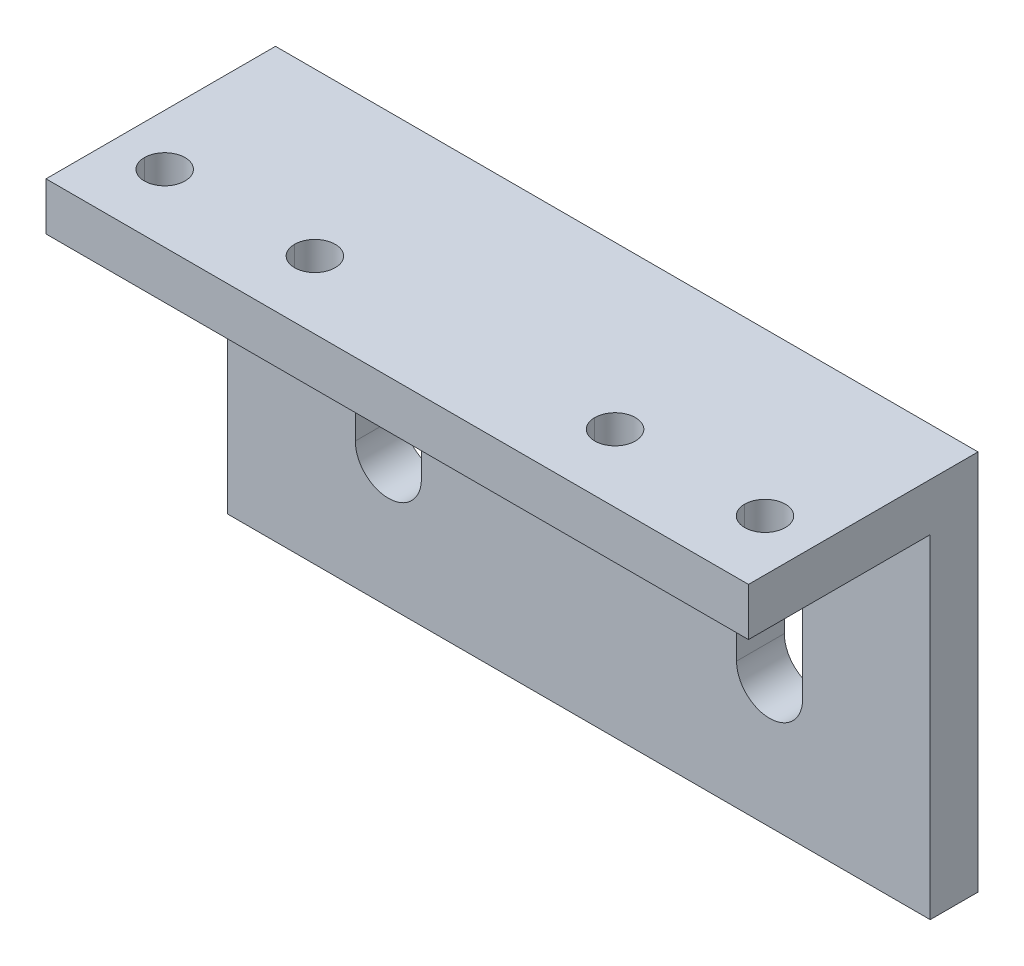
ISO-10303-21;
HEADER;
FILE_DESCRIPTION(('STEP AP214'),'2;1');
FILE_NAME('part.step','',(''),(''),'','','');
FILE_SCHEMA(('AUTOMOTIVE_DESIGN { 1 0 10303 214 1 1 1 1 }'));
ENDSEC;
DATA;
#1=APPLICATION_CONTEXT('core data for automotive mechanical design processes');
#2=APPLICATION_PROTOCOL_DEFINITION('international standard','automotive_design',2000,#1);
#3=PRODUCT_CONTEXT('',#1,'mechanical');
#4=PRODUCT('Part','Part','',(#3));
#5=PRODUCT_RELATED_PRODUCT_CATEGORY('part','',(#4));
#6=PRODUCT_DEFINITION_FORMATION('','',#4);
#7=PRODUCT_DEFINITION_CONTEXT('part definition',#1,'design');
#8=PRODUCT_DEFINITION('design','',#6,#7);
#9=PRODUCT_DEFINITION_SHAPE('','',#8);
#10=(LENGTH_UNIT() NAMED_UNIT(*) SI_UNIT(.MILLI.,.METRE.));
#11=(NAMED_UNIT(*) PLANE_ANGLE_UNIT() SI_UNIT($,.RADIAN.));
#12=(NAMED_UNIT(*) SI_UNIT($,.STERADIAN.) SOLID_ANGLE_UNIT());
#13=UNCERTAINTY_MEASURE_WITH_UNIT(LENGTH_MEASURE(1.E-05),#10,'distance_accuracy_value','');
#14=(GEOMETRIC_REPRESENTATION_CONTEXT(3) GLOBAL_UNCERTAINTY_ASSIGNED_CONTEXT((#13)) GLOBAL_UNIT_ASSIGNED_CONTEXT((#10,
#11,#12)) REPRESENTATION_CONTEXT('',''));
#15=CARTESIAN_POINT('',(0.,0.,0.));
#16=DIRECTION('',(0.,0.,1.));
#17=DIRECTION('',(1.,0.,0.));
#18=AXIS2_PLACEMENT_3D('',#15,#16,#17);
#19=CARTESIAN_POINT('',(-16.0528,-12.7,4.77519999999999));
#20=DIRECTION('',(0.,0.,1.));
#21=DIRECTION('',(0.,-1.,0.));
#22=AXIS2_PLACEMENT_3D('',#19,#20,#21);
#23=PLANE('',#22);
#24=DIRECTION('',(0.,1.,0.));
#25=VECTOR('',#24,1.);
#26=CARTESIAN_POINT('',(-16.0528,11.1082666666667,4.77519999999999));
#27=LINE('',#26,#25);
#28=CARTESIAN_POINT('',(-16.0528,-12.7,4.77519999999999));
#29=VERTEX_POINT('',#28);
#30=CARTESIAN_POINT('',(-16.0528,20.6248,4.77519999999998));
#31=VERTEX_POINT('',#30);
#32=EDGE_CURVE('E308',#29,#31,#27,.T.);
#33=ORIENTED_EDGE('',*,*,#32,.F.);
#34=DIRECTION('',(1.,0.,0.));
#35=VECTOR('',#34,1.);
#36=CARTESIAN_POINT('',(-16.0528,-12.7,4.77519999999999));
#37=LINE('',#36,#35);
#38=CARTESIAN_POINT('',(54.1528,-12.7,4.77519999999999));
#39=VERTEX_POINT('',#38);
#40=EDGE_CURVE('E303',#39,#29,#37,.F.);
#41=ORIENTED_EDGE('',*,*,#40,.F.);
#42=DIRECTION('',(0.,1.,0.));
#43=VECTOR('',#42,1.);
#44=CARTESIAN_POINT('',(54.1528,25.4,4.77519999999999));
#45=LINE('',#44,#43);
#46=CARTESIAN_POINT('',(54.1528,20.6248,4.77519999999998));
#47=VERTEX_POINT('',#46);
#48=EDGE_CURVE('E269',#39,#47,#45,.T.);
#49=ORIENTED_EDGE('',*,*,#48,.T.);
#50=DIRECTION('',(1.,0.,0.));
#51=VECTOR('',#50,1.);
#52=CARTESIAN_POINT('',(-16.0528,20.6248,4.77519999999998));
#53=LINE('',#52,#51);
#54=EDGE_CURVE('E169',#31,#47,#53,.T.);
#55=ORIENTED_EDGE('',*,*,#54,.F.);
#56=EDGE_LOOP('',(#33,#41,#49,#55));
#57=FACE_BOUND('',#56,.T.);
#58=CARTESIAN_POINT('',(0.,12.7,4.7752));
#59=DIRECTION('',(0.,0.,1.));
#60=DIRECTION('',(1.,0.,0.));
#61=AXIS2_PLACEMENT_3D('',#58,#59,#60);
#62=CIRCLE('',#61,3.302);
#63=CARTESIAN_POINT('',(-3.302,12.7,4.7752));
#64=VERTEX_POINT('',#63);
#65=CARTESIAN_POINT('',(3.302,12.7,4.7752));
#66=VERTEX_POINT('',#65);
#67=EDGE_CURVE('E212',#64,#66,#62,.F.);
#68=ORIENTED_EDGE('',*,*,#67,.T.);
#69=DIRECTION('',(0.,1.,0.));
#70=VECTOR('',#69,1.);
#71=CARTESIAN_POINT('',(3.302,12.7,4.7752));
#72=LINE('',#71,#70);
#73=CARTESIAN_POINT('',(3.302,0.,4.7752));
#74=VERTEX_POINT('',#73);
#75=EDGE_CURVE('E263',#66,#74,#72,.F.);
#76=ORIENTED_EDGE('',*,*,#75,.T.);
#77=CARTESIAN_POINT('',(0.,0.,4.7752));
#78=DIRECTION('',(0.,0.,1.));
#79=DIRECTION('',(1.,0.,0.));
#80=AXIS2_PLACEMENT_3D('',#77,#78,#79);
#81=CIRCLE('',#80,3.302);
#82=CARTESIAN_POINT('',(-3.302,0.,4.7752));
#83=VERTEX_POINT('',#82);
#84=EDGE_CURVE('E208',#74,#83,#81,.F.);
#85=ORIENTED_EDGE('',*,*,#84,.T.);
#86=DIRECTION('',(0.,1.,0.));
#87=VECTOR('',#86,1.);
#88=CARTESIAN_POINT('',(-3.302,0.,4.7752));
#89=LINE('',#88,#87);
#90=EDGE_CURVE('E266',#83,#64,#89,.T.);
#91=ORIENTED_EDGE('',*,*,#90,.T.);
#92=EDGE_LOOP('',(#68,#76,#85,#91));
#93=FACE_BOUND('',#92,.T.);
#94=DIRECTION('',(0.,1.,0.));
#95=VECTOR('',#94,1.);
#96=CARTESIAN_POINT('',(34.798,0.,4.7752));
#97=LINE('',#96,#95);
#98=CARTESIAN_POINT('',(34.798,0.,4.7752));
#99=VERTEX_POINT('',#98);
#100=CARTESIAN_POINT('',(34.798,12.7,4.7752));
#101=VERTEX_POINT('',#100);
#102=EDGE_CURVE('E256',#99,#101,#97,.T.);
#103=ORIENTED_EDGE('',*,*,#102,.T.);
#104=CARTESIAN_POINT('',(38.1,12.7,4.7752));
#105=DIRECTION('',(0.,0.,1.));
#106=DIRECTION('',(1.,0.,0.));
#107=AXIS2_PLACEMENT_3D('',#104,#105,#106);
#108=CIRCLE('',#107,3.302);
#109=CARTESIAN_POINT('',(41.402,12.7,4.7752));
#110=VERTEX_POINT('',#109);
#111=EDGE_CURVE('E200',#101,#110,#108,.F.);
#112=ORIENTED_EDGE('',*,*,#111,.T.);
#113=DIRECTION('',(0.,1.,0.));
#114=VECTOR('',#113,1.);
#115=CARTESIAN_POINT('',(41.402,12.7,4.7752));
#116=LINE('',#115,#114);
#117=CARTESIAN_POINT('',(41.402,0.,4.7752));
#118=VERTEX_POINT('',#117);
#119=EDGE_CURVE('E260',#110,#118,#116,.F.);
#120=ORIENTED_EDGE('',*,*,#119,.T.);
#121=CARTESIAN_POINT('',(38.1,0.,4.7752));
#122=DIRECTION('',(0.,0.,1.));
#123=DIRECTION('',(1.,0.,0.));
#124=AXIS2_PLACEMENT_3D('',#121,#122,#123);
#125=CIRCLE('',#124,3.302);
#126=EDGE_CURVE('E205',#118,#99,#125,.F.);
#127=ORIENTED_EDGE('',*,*,#126,.T.);
#128=EDGE_LOOP('',(#103,#112,#120,#127));
#129=FACE_BOUND('',#128,.T.);
#130=ADVANCED_FACE('F17',(#57,#93,#129),#23,.T.);
#131=CARTESIAN_POINT('',(-16.0528,20.6248,4.77519999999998));
#132=DIRECTION('',(0.,-1.,0.));
#133=DIRECTION('',(0.,0.,-1.));
#134=AXIS2_PLACEMENT_3D('',#131,#132,#133);
#135=PLANE('',#134);
#136=DIRECTION('',(0.,0.,1.));
#137=VECTOR('',#136,1.);
#138=CARTESIAN_POINT('',(-16.0528,20.6248,9.23713333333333));
#139=LINE('',#138,#137);
#140=CARTESIAN_POINT('',(-16.0528,20.6248,22.9362));
#141=VERTEX_POINT('',#140);
#142=EDGE_CURVE('E311',#31,#141,#139,.T.);
#143=ORIENTED_EDGE('',*,*,#142,.F.);
#144=ORIENTED_EDGE('',*,*,#54,.T.);
#145=DIRECTION('',(0.,0.,1.));
#146=VECTOR('',#145,1.);
#147=CARTESIAN_POINT('',(54.1528,20.6248,0.));
#148=LINE('',#147,#146);
#149=CARTESIAN_POINT('',(54.1528,20.6248,22.9362));
#150=VERTEX_POINT('',#149);
#151=EDGE_CURVE('E296',#47,#150,#148,.T.);
#152=ORIENTED_EDGE('',*,*,#151,.T.);
#153=DIRECTION('',(1.,0.,0.));
#154=VECTOR('',#153,1.);
#155=CARTESIAN_POINT('',(-16.0528,20.6247999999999,22.9362));
#156=LINE('',#155,#154);
#157=EDGE_CURVE('E262',#141,#150,#156,.T.);
#158=ORIENTED_EDGE('',*,*,#157,.F.);
#159=EDGE_LOOP('',(#143,#144,#152,#158));
#160=FACE_BOUND('',#159,.T.);
#161=CARTESIAN_POINT('',(-10.9474,20.6248,16.1798000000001));
#162=DIRECTION('',(0.,-1.,0.));
#163=DIRECTION('',(0.,0.,-1.));
#164=AXIS2_PLACEMENT_3D('',#161,#162,#163);
#165=CIRCLE('',#164,2.032);
#166=CARTESIAN_POINT('',(-8.9154,20.6248,16.1798000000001));
#167=VERTEX_POINT('',#166);
#168=CARTESIAN_POINT('',(-12.9794,20.6248,16.1798000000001));
#169=VERTEX_POINT('',#168);
#170=EDGE_CURVE('E196',#167,#169,#165,.F.);
#171=ORIENTED_EDGE('',*,*,#170,.T.);
#172=CARTESIAN_POINT('',(-10.9474,20.6248,16.1798000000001));
#173=DIRECTION('',(0.,-1.,0.));
#174=DIRECTION('',(0.,0.,-1.));
#175=AXIS2_PLACEMENT_3D('',#172,#173,#174);
#176=CIRCLE('',#175,2.032);
#177=EDGE_CURVE('E194',#169,#167,#176,.F.);
#178=ORIENTED_EDGE('',*,*,#177,.T.);
#179=EDGE_LOOP('',(#171,#178));
#180=FACE_BOUND('',#179,.T.);
#181=CARTESIAN_POINT('',(49.0474,20.6248,16.1798000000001));
#182=DIRECTION('',(0.,-1.,0.));
#183=DIRECTION('',(0.,0.,-1.));
#184=AXIS2_PLACEMENT_3D('',#181,#182,#183);
#185=CIRCLE('',#184,2.032);
#186=CARTESIAN_POINT('',(51.0794,20.6248,16.1798000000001));
#187=VERTEX_POINT('',#186);
#188=CARTESIAN_POINT('',(47.0154,20.6248,16.1798000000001));
#189=VERTEX_POINT('',#188);
#190=EDGE_CURVE('E190',#187,#189,#185,.F.);
#191=ORIENTED_EDGE('',*,*,#190,.T.);
#192=CARTESIAN_POINT('',(49.0474,20.6248,16.1798000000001));
#193=DIRECTION('',(0.,-1.,0.));
#194=DIRECTION('',(0.,0.,-1.));
#195=AXIS2_PLACEMENT_3D('',#192,#193,#194);
#196=CIRCLE('',#195,2.032);
#197=EDGE_CURVE('E188',#189,#187,#196,.F.);
#198=ORIENTED_EDGE('',*,*,#197,.T.);
#199=EDGE_LOOP('',(#191,#198));
#200=FACE_BOUND('',#199,.T.);
#201=CARTESIAN_POINT('',(4.064,20.6248,16.1798000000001));
#202=DIRECTION('',(0.,-1.,0.));
#203=DIRECTION('',(0.,0.,-1.));
#204=AXIS2_PLACEMENT_3D('',#201,#202,#203);
#205=CIRCLE('',#204,2.032);
#206=CARTESIAN_POINT('',(6.096,20.6248,16.1798000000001));
#207=VERTEX_POINT('',#206);
#208=CARTESIAN_POINT('',(2.032,20.6248,16.1798000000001));
#209=VERTEX_POINT('',#208);
#210=EDGE_CURVE('E185',#207,#209,#205,.F.);
#211=ORIENTED_EDGE('',*,*,#210,.T.);
#212=CARTESIAN_POINT('',(4.064,20.6248,16.1798000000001));
#213=DIRECTION('',(0.,-1.,0.));
#214=DIRECTION('',(0.,0.,-1.));
#215=AXIS2_PLACEMENT_3D('',#212,#213,#214);
#216=CIRCLE('',#215,2.032);
#217=EDGE_CURVE('E178',#209,#207,#216,.F.);
#218=ORIENTED_EDGE('',*,*,#217,.T.);
#219=EDGE_LOOP('',(#211,#218));
#220=FACE_BOUND('',#219,.T.);
#221=CARTESIAN_POINT('',(34.0614,20.6248,16.1798000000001));
#222=DIRECTION('',(0.,-1.,0.));
#223=DIRECTION('',(0.,0.,-1.));
#224=AXIS2_PLACEMENT_3D('',#221,#222,#223);
#225=CIRCLE('',#224,2.032);
#226=CARTESIAN_POINT('',(36.0934,20.6248,16.1798000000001));
#227=VERTEX_POINT('',#226);
#228=CARTESIAN_POINT('',(32.0294,20.6248,16.1798000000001));
#229=VERTEX_POINT('',#228);
#230=EDGE_CURVE('E163',#227,#229,#225,.F.);
#231=ORIENTED_EDGE('',*,*,#230,.T.);
#232=CARTESIAN_POINT('',(34.0614,20.6248,16.1798000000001));
#233=DIRECTION('',(0.,-1.,0.));
#234=DIRECTION('',(0.,0.,-1.));
#235=AXIS2_PLACEMENT_3D('',#232,#233,#234);
#236=CIRCLE('',#235,2.032);
#237=EDGE_CURVE('E20',#229,#227,#236,.F.);
#238=ORIENTED_EDGE('',*,*,#237,.T.);
#239=EDGE_LOOP('',(#231,#238));
#240=FACE_BOUND('',#239,.T.);
#241=ADVANCED_FACE('F166',(#160,#180,#200,#220,#240),#135,.T.);
#242=CARTESIAN_POINT('',(34.0614,25.4,16.1798000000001));
#243=DIRECTION('',(0.,-1.,0.));
#244=DIRECTION('',(0.,0.,-1.));
#245=AXIS2_PLACEMENT_3D('',#242,#243,#244);
#246=CYLINDRICAL_SURFACE('',#245,2.032);
#247=ORIENTED_EDGE('',*,*,#237,.F.);
#248=DIRECTION('',(0.,-1.,0.));
#249=VECTOR('',#248,1.);
#250=CARTESIAN_POINT('',(32.0294,25.4,16.1798000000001));
#251=LINE('',#250,#249);
#252=CARTESIAN_POINT('',(32.0294,25.4,16.1798000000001));
#253=VERTEX_POINT('',#252);
#254=EDGE_CURVE('E179',#229,#253,#251,.F.);
#255=ORIENTED_EDGE('',*,*,#254,.T.);
#256=CARTESIAN_POINT('',(34.0614,25.4,16.1798000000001));
#257=DIRECTION('',(0.,-1.,0.));
#258=DIRECTION('',(0.,0.,-1.));
#259=AXIS2_PLACEMENT_3D('',#256,#257,#258);
#260=CIRCLE('',#259,2.032);
#261=CARTESIAN_POINT('',(36.0934,25.4,16.1798000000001));
#262=VERTEX_POINT('',#261);
#263=EDGE_CURVE('E174',#262,#253,#260,.T.);
#264=ORIENTED_EDGE('',*,*,#263,.F.);
#265=DIRECTION('',(0.,-1.,0.));
#266=VECTOR('',#265,1.);
#267=CARTESIAN_POINT('',(36.0934,25.4,16.1798000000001));
#268=LINE('',#267,#266);
#269=EDGE_CURVE('E171',#262,#227,#268,.T.);
#270=ORIENTED_EDGE('',*,*,#269,.T.);
#271=EDGE_LOOP('',(#247,#255,#264,#270));
#272=FACE_BOUND('',#271,.T.);
#273=ADVANCED_FACE('F172',(#272),#246,.F.);
#274=CARTESIAN_POINT('',(34.0614,25.4,16.1798000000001));
#275=DIRECTION('',(0.,-1.,0.));
#276=DIRECTION('',(0.,0.,-1.));
#277=AXIS2_PLACEMENT_3D('',#274,#275,#276);
#278=CYLINDRICAL_SURFACE('',#277,2.032);
#279=CARTESIAN_POINT('',(34.0614,25.4,16.1798000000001));
#280=DIRECTION('',(0.,-1.,0.));
#281=DIRECTION('',(0.,0.,-1.));
#282=AXIS2_PLACEMENT_3D('',#279,#280,#281);
#283=CIRCLE('',#282,2.032);
#284=EDGE_CURVE('E218',#253,#262,#283,.T.);
#285=ORIENTED_EDGE('',*,*,#284,.F.);
#286=ORIENTED_EDGE('',*,*,#254,.F.);
#287=ORIENTED_EDGE('',*,*,#230,.F.);
#288=ORIENTED_EDGE('',*,*,#269,.F.);
#289=EDGE_LOOP('',(#285,#286,#287,#288));
#290=FACE_BOUND('',#289,.T.);
#291=ADVANCED_FACE('F181',(#290),#278,.F.);
#292=CARTESIAN_POINT('',(4.064,25.4,16.1798000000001));
#293=DIRECTION('',(0.,-1.,0.));
#294=DIRECTION('',(0.,0.,-1.));
#295=AXIS2_PLACEMENT_3D('',#292,#293,#294);
#296=CYLINDRICAL_SURFACE('',#295,2.032);
#297=ORIENTED_EDGE('',*,*,#217,.F.);
#298=DIRECTION('',(0.,-1.,0.));
#299=VECTOR('',#298,1.);
#300=CARTESIAN_POINT('',(2.032,25.4,16.1798000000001));
#301=LINE('',#300,#299);
#302=CARTESIAN_POINT('',(2.032,25.4,16.1798000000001));
#303=VERTEX_POINT('',#302);
#304=EDGE_CURVE('E187',#209,#303,#301,.F.);
#305=ORIENTED_EDGE('',*,*,#304,.T.);
#306=CARTESIAN_POINT('',(4.064,25.4,16.1798000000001));
#307=DIRECTION('',(0.,-1.,0.));
#308=DIRECTION('',(0.,0.,-1.));
#309=AXIS2_PLACEMENT_3D('',#306,#307,#308);
#310=CIRCLE('',#309,2.032);
#311=CARTESIAN_POINT('',(6.096,25.4,16.1798000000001));
#312=VERTEX_POINT('',#311);
#313=EDGE_CURVE('E221',#312,#303,#310,.T.);
#314=ORIENTED_EDGE('',*,*,#313,.F.);
#315=DIRECTION('',(0.,-1.,0.));
#316=VECTOR('',#315,1.);
#317=CARTESIAN_POINT('',(6.096,25.4,16.1798000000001));
#318=LINE('',#317,#316);
#319=EDGE_CURVE('E191',#312,#207,#318,.T.);
#320=ORIENTED_EDGE('',*,*,#319,.T.);
#321=EDGE_LOOP('',(#297,#305,#314,#320));
#322=FACE_BOUND('',#321,.T.);
#323=ADVANCED_FACE('F532',(#322),#296,.F.);
#324=CARTESIAN_POINT('',(4.064,25.4,16.1798000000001));
#325=DIRECTION('',(0.,-1.,0.));
#326=DIRECTION('',(0.,0.,-1.));
#327=AXIS2_PLACEMENT_3D('',#324,#325,#326);
#328=CYLINDRICAL_SURFACE('',#327,2.032);
#329=CARTESIAN_POINT('',(4.064,25.4,16.1798000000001));
#330=DIRECTION('',(0.,-1.,0.));
#331=DIRECTION('',(0.,0.,-1.));
#332=AXIS2_PLACEMENT_3D('',#329,#330,#331);
#333=CIRCLE('',#332,2.032);
#334=EDGE_CURVE('E224',#303,#312,#333,.T.);
#335=ORIENTED_EDGE('',*,*,#334,.F.);
#336=ORIENTED_EDGE('',*,*,#304,.F.);
#337=ORIENTED_EDGE('',*,*,#210,.F.);
#338=ORIENTED_EDGE('',*,*,#319,.F.);
#339=EDGE_LOOP('',(#335,#336,#337,#338));
#340=FACE_BOUND('',#339,.T.);
#341=ADVANCED_FACE('F523',(#340),#328,.F.);
#342=CARTESIAN_POINT('',(49.0474,25.4,16.1798000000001));
#343=DIRECTION('',(0.,-1.,0.));
#344=DIRECTION('',(0.,0.,-1.));
#345=AXIS2_PLACEMENT_3D('',#342,#343,#344);
#346=CYLINDRICAL_SURFACE('',#345,2.032);
#347=ORIENTED_EDGE('',*,*,#197,.F.);
#348=DIRECTION('',(0.,-1.,0.));
#349=VECTOR('',#348,1.);
#350=CARTESIAN_POINT('',(47.0154,25.4,16.1798000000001));
#351=LINE('',#350,#349);
#352=CARTESIAN_POINT('',(47.0154,25.4,16.1798000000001));
#353=VERTEX_POINT('',#352);
#354=EDGE_CURVE('E193',#189,#353,#351,.F.);
#355=ORIENTED_EDGE('',*,*,#354,.T.);
#356=CARTESIAN_POINT('',(49.0474,25.4,16.1798000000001));
#357=DIRECTION('',(0.,-1.,0.));
#358=DIRECTION('',(0.,0.,-1.));
#359=AXIS2_PLACEMENT_3D('',#356,#357,#358);
#360=CIRCLE('',#359,2.032);
#361=CARTESIAN_POINT('',(51.0794,25.4,16.1798000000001));
#362=VERTEX_POINT('',#361);
#363=EDGE_CURVE('E227',#362,#353,#360,.T.);
#364=ORIENTED_EDGE('',*,*,#363,.F.);
#365=DIRECTION('',(0.,-1.,0.));
#366=VECTOR('',#365,1.);
#367=CARTESIAN_POINT('',(51.0794,25.4,16.1798000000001));
#368=LINE('',#367,#366);
#369=EDGE_CURVE('E197',#362,#187,#368,.T.);
#370=ORIENTED_EDGE('',*,*,#369,.T.);
#371=EDGE_LOOP('',(#347,#355,#364,#370));
#372=FACE_BOUND('',#371,.T.);
#373=ADVANCED_FACE('F514',(#372),#346,.F.);
#374=CARTESIAN_POINT('',(49.0474,25.4,16.1798000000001));
#375=DIRECTION('',(0.,-1.,0.));
#376=DIRECTION('',(0.,0.,-1.));
#377=AXIS2_PLACEMENT_3D('',#374,#375,#376);
#378=CYLINDRICAL_SURFACE('',#377,2.032);
#379=CARTESIAN_POINT('',(49.0474,25.4,16.1798000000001));
#380=DIRECTION('',(0.,-1.,0.));
#381=DIRECTION('',(0.,0.,-1.));
#382=AXIS2_PLACEMENT_3D('',#379,#380,#381);
#383=CIRCLE('',#382,2.032);
#384=EDGE_CURVE('E230',#353,#362,#383,.T.);
#385=ORIENTED_EDGE('',*,*,#384,.F.);
#386=ORIENTED_EDGE('',*,*,#354,.F.);
#387=ORIENTED_EDGE('',*,*,#190,.F.);
#388=ORIENTED_EDGE('',*,*,#369,.F.);
#389=EDGE_LOOP('',(#385,#386,#387,#388));
#390=FACE_BOUND('',#389,.T.);
#391=ADVANCED_FACE('F505',(#390),#378,.F.);
#392=CARTESIAN_POINT('',(-10.9474,25.4,16.1798000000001));
#393=DIRECTION('',(0.,-1.,0.));
#394=DIRECTION('',(0.,0.,-1.));
#395=AXIS2_PLACEMENT_3D('',#392,#393,#394);
#396=CYLINDRICAL_SURFACE('',#395,2.032);
#397=ORIENTED_EDGE('',*,*,#177,.F.);
#398=DIRECTION('',(0.,-1.,0.));
#399=VECTOR('',#398,1.);
#400=CARTESIAN_POINT('',(-12.9794,25.4,16.1798000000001));
#401=LINE('',#400,#399);
#402=CARTESIAN_POINT('',(-12.9794,25.4,16.1798000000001));
#403=VERTEX_POINT('',#402);
#404=EDGE_CURVE('E199',#169,#403,#401,.F.);
#405=ORIENTED_EDGE('',*,*,#404,.T.);
#406=CARTESIAN_POINT('',(-10.9474,25.4,16.1798000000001));
#407=DIRECTION('',(0.,-1.,0.));
#408=DIRECTION('',(0.,0.,-1.));
#409=AXIS2_PLACEMENT_3D('',#406,#407,#408);
#410=CIRCLE('',#409,2.032);
#411=CARTESIAN_POINT('',(-8.9154,25.4,16.1798000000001));
#412=VERTEX_POINT('',#411);
#413=EDGE_CURVE('E233',#412,#403,#410,.T.);
#414=ORIENTED_EDGE('',*,*,#413,.F.);
#415=DIRECTION('',(0.,-1.,0.));
#416=VECTOR('',#415,1.);
#417=CARTESIAN_POINT('',(-8.9154,25.4,16.1798000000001));
#418=LINE('',#417,#416);
#419=EDGE_CURVE('E279',#412,#167,#418,.T.);
#420=ORIENTED_EDGE('',*,*,#419,.T.);
#421=EDGE_LOOP('',(#397,#405,#414,#420));
#422=FACE_BOUND('',#421,.T.);
#423=ADVANCED_FACE('F496',(#422),#396,.F.);
#424=CARTESIAN_POINT('',(-10.9474,25.4,16.1798000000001));
#425=DIRECTION('',(0.,-1.,0.));
#426=DIRECTION('',(0.,0.,-1.));
#427=AXIS2_PLACEMENT_3D('',#424,#425,#426);
#428=CYLINDRICAL_SURFACE('',#427,2.032);
#429=CARTESIAN_POINT('',(-10.9474,25.4,16.1798000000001));
#430=DIRECTION('',(0.,-1.,0.));
#431=DIRECTION('',(0.,0.,-1.));
#432=AXIS2_PLACEMENT_3D('',#429,#430,#431);
#433=CIRCLE('',#432,2.032);
#434=EDGE_CURVE('E236',#403,#412,#433,.T.);
#435=ORIENTED_EDGE('',*,*,#434,.F.);
#436=ORIENTED_EDGE('',*,*,#404,.F.);
#437=ORIENTED_EDGE('',*,*,#170,.F.);
#438=ORIENTED_EDGE('',*,*,#419,.F.);
#439=EDGE_LOOP('',(#435,#436,#437,#438));
#440=FACE_BOUND('',#439,.T.);
#441=ADVANCED_FACE('F488',(#440),#428,.F.);
#442=CARTESIAN_POINT('',(-16.0528,20.6247999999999,22.9362));
#443=DIRECTION('',(0.,0.,1.));
#444=DIRECTION('',(0.,-1.,0.));
#445=AXIS2_PLACEMENT_3D('',#442,#443,#444);
#446=PLANE('',#445);
#447=DIRECTION('',(0.,1.,0.));
#448=VECTOR('',#447,1.);
#449=CARTESIAN_POINT('',(-16.0528,11.1082666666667,22.9362));
#450=LINE('',#449,#448);
#451=CARTESIAN_POINT('',(-16.0528,25.4,22.9362));
#452=VERTEX_POINT('',#451);
#453=EDGE_CURVE('E219',#141,#452,#450,.T.);
#454=ORIENTED_EDGE('',*,*,#453,.F.);
#455=ORIENTED_EDGE('',*,*,#157,.T.);
#456=DIRECTION('',(0.,1.,0.));
#457=VECTOR('',#456,1.);
#458=CARTESIAN_POINT('',(54.1528,25.4,22.9362));
#459=LINE('',#458,#457);
#460=CARTESIAN_POINT('',(54.1528,25.4,22.9362));
#461=VERTEX_POINT('',#460);
#462=EDGE_CURVE('E298',#150,#461,#459,.T.);
#463=ORIENTED_EDGE('',*,*,#462,.T.);
#464=DIRECTION('',(1.,0.,0.));
#465=VECTOR('',#464,1.);
#466=CARTESIAN_POINT('',(-16.0528,25.4,22.9362));
#467=LINE('',#466,#465);
#468=EDGE_CURVE('E318',#452,#461,#467,.T.);
#469=ORIENTED_EDGE('',*,*,#468,.F.);
#470=EDGE_LOOP('',(#454,#455,#463,#469));
#471=FACE_BOUND('',#470,.T.);
#472=ADVANCED_FACE('F354',(#471),#446,.T.);
#473=CARTESIAN_POINT('',(41.402,12.7,0.));
#474=DIRECTION('',(1.,0.,0.));
#475=DIRECTION('',(0.,0.,-1.));
#476=AXIS2_PLACEMENT_3D('',#473,#474,#475);
#477=PLANE('',#476);
#478=DIRECTION('',(0.,0.,1.));
#479=VECTOR('',#478,1.);
#480=CARTESIAN_POINT('',(41.402,12.7,0.));
#481=LINE('',#480,#479);
#482=CARTESIAN_POINT('',(41.402,12.7,0.));
#483=VERTEX_POINT('',#482);
#484=EDGE_CURVE('E204',#110,#483,#481,.F.);
#485=ORIENTED_EDGE('',*,*,#484,.T.);
#486=DIRECTION('',(0.,1.,0.));
#487=VECTOR('',#486,1.);
#488=CARTESIAN_POINT('',(41.402,25.4,0.));
#489=LINE('',#488,#487);
#490=CARTESIAN_POINT('',(41.402,0.,0.));
#491=VERTEX_POINT('',#490);
#492=EDGE_CURVE('E244',#491,#483,#489,.T.);
#493=ORIENTED_EDGE('',*,*,#492,.F.);
#494=DIRECTION('',(0.,0.,1.));
#495=VECTOR('',#494,1.);
#496=CARTESIAN_POINT('',(41.402,0.,0.));
#497=LINE('',#496,#495);
#498=EDGE_CURVE('E209',#491,#118,#497,.T.);
#499=ORIENTED_EDGE('',*,*,#498,.T.);
#500=ORIENTED_EDGE('',*,*,#119,.F.);
#501=EDGE_LOOP('',(#485,#493,#499,#500));
#502=FACE_BOUND('',#501,.T.);
#503=ADVANCED_FACE('F471',(#502),#477,.F.);
#504=CARTESIAN_POINT('',(38.1,12.7,0.));
#505=DIRECTION('',(0.,0.,1.));
#506=DIRECTION('',(1.,0.,0.));
#507=AXIS2_PLACEMENT_3D('',#504,#505,#506);
#508=CYLINDRICAL_SURFACE('',#507,3.302);
#509=DIRECTION('',(0.,0.,1.));
#510=VECTOR('',#509,1.);
#511=CARTESIAN_POINT('',(34.798,12.7,0.));
#512=LINE('',#511,#510);
#513=CARTESIAN_POINT('',(34.798,12.7,0.));
#514=VERTEX_POINT('',#513);
#515=EDGE_CURVE('E203',#101,#514,#512,.F.);
#516=ORIENTED_EDGE('',*,*,#515,.T.);
#517=CARTESIAN_POINT('',(38.1,12.7,0.));
#518=DIRECTION('',(0.,0.,1.));
#519=DIRECTION('',(1.,0.,0.));
#520=AXIS2_PLACEMENT_3D('',#517,#518,#519);
#521=CIRCLE('',#520,3.302);
#522=EDGE_CURVE('E240',#483,#514,#521,.T.);
#523=ORIENTED_EDGE('',*,*,#522,.F.);
#524=ORIENTED_EDGE('',*,*,#484,.F.);
#525=ORIENTED_EDGE('',*,*,#111,.F.);
#526=EDGE_LOOP('',(#516,#523,#524,#525));
#527=FACE_BOUND('',#526,.T.);
#528=ADVANCED_FACE('F462',(#527),#508,.F.);
#529=CARTESIAN_POINT('',(34.798,0.,0.));
#530=DIRECTION('',(-1.,0.,0.));
#531=DIRECTION('',(0.,0.,1.));
#532=AXIS2_PLACEMENT_3D('',#529,#530,#531);
#533=PLANE('',#532);
#534=DIRECTION('',(0.,0.,1.));
#535=VECTOR('',#534,1.);
#536=CARTESIAN_POINT('',(34.798,0.,0.));
#537=LINE('',#536,#535);
#538=CARTESIAN_POINT('',(34.798,0.,0.));
#539=VERTEX_POINT('',#538);
#540=EDGE_CURVE('E259',#99,#539,#537,.F.);
#541=ORIENTED_EDGE('',*,*,#540,.T.);
#542=DIRECTION('',(0.,1.,0.));
#543=VECTOR('',#542,1.);
#544=CARTESIAN_POINT('',(34.798,25.4,0.));
#545=LINE('',#544,#543);
#546=EDGE_CURVE('E243',#514,#539,#545,.F.);
#547=ORIENTED_EDGE('',*,*,#546,.F.);
#548=ORIENTED_EDGE('',*,*,#515,.F.);
#549=ORIENTED_EDGE('',*,*,#102,.F.);
#550=EDGE_LOOP('',(#541,#547,#548,#549));
#551=FACE_BOUND('',#550,.T.);
#552=ADVANCED_FACE('F453',(#551),#533,.F.);
#553=CARTESIAN_POINT('',(38.1,0.,0.));
#554=DIRECTION('',(0.,0.,1.));
#555=DIRECTION('',(1.,0.,0.));
#556=AXIS2_PLACEMENT_3D('',#553,#554,#555);
#557=CYLINDRICAL_SURFACE('',#556,3.302);
#558=ORIENTED_EDGE('',*,*,#498,.F.);
#559=CARTESIAN_POINT('',(38.1,0.,0.));
#560=DIRECTION('',(0.,0.,1.));
#561=DIRECTION('',(1.,0.,0.));
#562=AXIS2_PLACEMENT_3D('',#559,#560,#561);
#563=CIRCLE('',#562,3.302);
#564=EDGE_CURVE('E245',#539,#491,#563,.T.);
#565=ORIENTED_EDGE('',*,*,#564,.F.);
#566=ORIENTED_EDGE('',*,*,#540,.F.);
#567=ORIENTED_EDGE('',*,*,#126,.F.);
#568=EDGE_LOOP('',(#558,#565,#566,#567));
#569=FACE_BOUND('',#568,.T.);
#570=ADVANCED_FACE('F444',(#569),#557,.F.);
#571=CARTESIAN_POINT('',(0.,0.,0.));
#572=DIRECTION('',(0.,0.,1.));
#573=DIRECTION('',(1.,0.,0.));
#574=AXIS2_PLACEMENT_3D('',#571,#572,#573);
#575=CYLINDRICAL_SURFACE('',#574,3.302);
#576=DIRECTION('',(0.,0.,-1.));
#577=VECTOR('',#576,1.);
#578=CARTESIAN_POINT('',(3.302,0.,0.));
#579=LINE('',#578,#577);
#580=CARTESIAN_POINT('',(3.302,0.,0.));
#581=VERTEX_POINT('',#580);
#582=EDGE_CURVE('E211',#74,#581,#579,.T.);
#583=ORIENTED_EDGE('',*,*,#582,.T.);
#584=CARTESIAN_POINT('',(0.,0.,0.));
#585=DIRECTION('',(0.,0.,1.));
#586=DIRECTION('',(1.,0.,0.));
#587=AXIS2_PLACEMENT_3D('',#584,#585,#586);
#588=CIRCLE('',#587,3.302);
#589=CARTESIAN_POINT('',(-3.302,0.,0.));
#590=VERTEX_POINT('',#589);
#591=EDGE_CURVE('E248',#590,#581,#588,.T.);
#592=ORIENTED_EDGE('',*,*,#591,.F.);
#593=DIRECTION('',(0.,0.,1.));
#594=VECTOR('',#593,1.);
#595=CARTESIAN_POINT('',(-3.302,0.,0.));
#596=LINE('',#595,#594);
#597=EDGE_CURVE('E270',#590,#83,#596,.T.);
#598=ORIENTED_EDGE('',*,*,#597,.T.);
#599=ORIENTED_EDGE('',*,*,#84,.F.);
#600=EDGE_LOOP('',(#583,#592,#598,#599));
#601=FACE_BOUND('',#600,.T.);
#602=ADVANCED_FACE('F435',(#601),#575,.F.);
#603=CARTESIAN_POINT('',(3.302,12.7,0.));
#604=DIRECTION('',(1.,0.,0.));
#605=DIRECTION('',(0.,0.,-1.));
#606=AXIS2_PLACEMENT_3D('',#603,#604,#605);
#607=PLANE('',#606);
#608=DIRECTION('',(0.,0.,1.));
#609=VECTOR('',#608,1.);
#610=CARTESIAN_POINT('',(3.302,12.7,0.));
#611=LINE('',#610,#609);
#612=CARTESIAN_POINT('',(3.302,12.7,0.));
#613=VERTEX_POINT('',#612);
#614=EDGE_CURVE('E216',#66,#613,#611,.F.);
#615=ORIENTED_EDGE('',*,*,#614,.T.);
#616=DIRECTION('',(0.,1.,0.));
#617=VECTOR('',#616,1.);
#618=CARTESIAN_POINT('',(3.302,25.4,0.));
#619=LINE('',#618,#617);
#620=EDGE_CURVE('E251',#581,#613,#619,.T.);
#621=ORIENTED_EDGE('',*,*,#620,.F.);
#622=ORIENTED_EDGE('',*,*,#582,.F.);
#623=ORIENTED_EDGE('',*,*,#75,.F.);
#624=EDGE_LOOP('',(#615,#621,#622,#623));
#625=FACE_BOUND('',#624,.T.);
#626=ADVANCED_FACE('F426',(#625),#607,.F.);
#627=CARTESIAN_POINT('',(0.,12.7,0.));
#628=DIRECTION('',(0.,0.,1.));
#629=DIRECTION('',(1.,0.,0.));
#630=AXIS2_PLACEMENT_3D('',#627,#628,#629);
#631=CYLINDRICAL_SURFACE('',#630,3.302);
#632=DIRECTION('',(0.,0.,1.));
#633=VECTOR('',#632,1.);
#634=CARTESIAN_POINT('',(-3.302,12.7,0.));
#635=LINE('',#634,#633);
#636=CARTESIAN_POINT('',(-3.302,12.7,0.));
#637=VERTEX_POINT('',#636);
#638=EDGE_CURVE('E215',#64,#637,#635,.F.);
#639=ORIENTED_EDGE('',*,*,#638,.T.);
#640=CARTESIAN_POINT('',(0.,12.7,0.));
#641=DIRECTION('',(0.,0.,1.));
#642=DIRECTION('',(1.,0.,0.));
#643=AXIS2_PLACEMENT_3D('',#640,#641,#642);
#644=CIRCLE('',#643,3.302);
#645=EDGE_CURVE('E252',#613,#637,#644,.T.);
#646=ORIENTED_EDGE('',*,*,#645,.F.);
#647=ORIENTED_EDGE('',*,*,#614,.F.);
#648=ORIENTED_EDGE('',*,*,#67,.F.);
#649=EDGE_LOOP('',(#639,#646,#647,#648));
#650=FACE_BOUND('',#649,.T.);
#651=ADVANCED_FACE('F371',(#650),#631,.F.);
#652=CARTESIAN_POINT('',(-3.302,0.,0.));
#653=DIRECTION('',(-1.,0.,0.));
#654=DIRECTION('',(0.,0.,1.));
#655=AXIS2_PLACEMENT_3D('',#652,#653,#654);
#656=PLANE('',#655);
#657=ORIENTED_EDGE('',*,*,#597,.F.);
#658=DIRECTION('',(0.,1.,0.));
#659=VECTOR('',#658,1.);
#660=CARTESIAN_POINT('',(-3.302,25.4,0.));
#661=LINE('',#660,#659);
#662=EDGE_CURVE('E255',#637,#590,#661,.F.);
#663=ORIENTED_EDGE('',*,*,#662,.F.);
#664=ORIENTED_EDGE('',*,*,#638,.F.);
#665=ORIENTED_EDGE('',*,*,#90,.F.);
#666=EDGE_LOOP('',(#657,#663,#664,#665));
#667=FACE_BOUND('',#666,.T.);
#668=ADVANCED_FACE('F363',(#667),#656,.F.);
#669=CARTESIAN_POINT('',(54.1528,25.4,0.));
#670=DIRECTION('',(-1.,0.,0.));
#671=DIRECTION('',(0.,0.,1.));
#672=AXIS2_PLACEMENT_3D('',#669,#670,#671);
#673=PLANE('',#672);
#674=DIRECTION('',(0.,0.,1.));
#675=VECTOR('',#674,1.);
#676=CARTESIAN_POINT('',(54.1528,25.4,22.9362));
#677=LINE('',#676,#675);
#678=CARTESIAN_POINT('',(54.1528,25.4,0.));
#679=VERTEX_POINT('',#678);
#680=EDGE_CURVE('E239',#461,#679,#677,.F.);
#681=ORIENTED_EDGE('',*,*,#680,.F.);
#682=ORIENTED_EDGE('',*,*,#462,.F.);
#683=ORIENTED_EDGE('',*,*,#151,.F.);
#684=ORIENTED_EDGE('',*,*,#48,.F.);
#685=DIRECTION('',(0.,0.,-1.));
#686=VECTOR('',#685,1.);
#687=CARTESIAN_POINT('',(54.1528,-12.7,0.));
#688=LINE('',#687,#686);
#689=CARTESIAN_POINT('',(54.1528,-12.7,0.));
#690=VERTEX_POINT('',#689);
#691=EDGE_CURVE('E300',#690,#39,#688,.F.);
#692=ORIENTED_EDGE('',*,*,#691,.F.);
#693=DIRECTION('',(0.,1.,0.));
#694=VECTOR('',#693,1.);
#695=CARTESIAN_POINT('',(54.1528,25.4,0.));
#696=LINE('',#695,#694);
#697=EDGE_CURVE('E329',#679,#690,#696,.F.);
#698=ORIENTED_EDGE('',*,*,#697,.F.);
#699=EDGE_LOOP('',(#681,#682,#683,#684,#692,#698));
#700=FACE_BOUND('',#699,.T.);
#701=ADVANCED_FACE('F361',(#700),#673,.F.);
#702=CARTESIAN_POINT('',(-16.0528,-12.7,0.));
#703=DIRECTION('',(0.,-1.,0.));
#704=DIRECTION('',(0.,0.,-1.));
#705=AXIS2_PLACEMENT_3D('',#702,#703,#704);
#706=PLANE('',#705);
#707=DIRECTION('',(0.,0.,1.));
#708=VECTOR('',#707,1.);
#709=CARTESIAN_POINT('',(-16.0528,-12.7,9.23713333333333));
#710=LINE('',#709,#708);
#711=CARTESIAN_POINT('',(-16.0528,-12.7,0.));
#712=VERTEX_POINT('',#711);
#713=EDGE_CURVE('E305',#712,#29,#710,.T.);
#714=ORIENTED_EDGE('',*,*,#713,.F.);
#715=DIRECTION('',(1.,0.,0.));
#716=VECTOR('',#715,1.);
#717=CARTESIAN_POINT('',(-16.0528,-12.7,0.));
#718=LINE('',#717,#716);
#719=EDGE_CURVE('E332',#690,#712,#718,.F.);
#720=ORIENTED_EDGE('',*,*,#719,.F.);
#721=ORIENTED_EDGE('',*,*,#691,.T.);
#722=ORIENTED_EDGE('',*,*,#40,.T.);
#723=EDGE_LOOP('',(#714,#720,#721,#722));
#724=FACE_BOUND('',#723,.T.);
#725=ADVANCED_FACE('F343',(#724),#706,.T.);
#726=CARTESIAN_POINT('',(-16.0528,11.1082666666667,9.23713333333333));
#727=DIRECTION('',(-1.,0.,0.));
#728=DIRECTION('',(0.,0.,1.));
#729=AXIS2_PLACEMENT_3D('',#726,#727,#728);
#730=PLANE('',#729);
#731=ORIENTED_EDGE('',*,*,#142,.T.);
#732=ORIENTED_EDGE('',*,*,#453,.T.);
#733=DIRECTION('',(0.,0.,1.));
#734=VECTOR('',#733,1.);
#735=CARTESIAN_POINT('',(-16.0528,25.4,22.9362));
#736=LINE('',#735,#734);
#737=CARTESIAN_POINT('',(-16.0528,25.4,0.));
#738=VERTEX_POINT('',#737);
#739=EDGE_CURVE('E35',#738,#452,#736,.T.);
#740=ORIENTED_EDGE('',*,*,#739,.F.);
#741=DIRECTION('',(0.,1.,0.));
#742=VECTOR('',#741,1.);
#743=CARTESIAN_POINT('',(-16.0528,25.4,0.));
#744=LINE('',#743,#742);
#745=EDGE_CURVE('E26',#712,#738,#744,.T.);
#746=ORIENTED_EDGE('',*,*,#745,.F.);
#747=ORIENTED_EDGE('',*,*,#713,.T.);
#748=ORIENTED_EDGE('',*,*,#32,.T.);
#749=EDGE_LOOP('',(#731,#732,#740,#746,#747,#748));
#750=FACE_BOUND('',#749,.T.);
#751=ADVANCED_FACE('F340',(#750),#730,.T.);
#752=CARTESIAN_POINT('',(-16.0528,25.4,22.9362));
#753=DIRECTION('',(0.,1.,0.));
#754=DIRECTION('',(0.,0.,1.));
#755=AXIS2_PLACEMENT_3D('',#752,#753,#754);
#756=PLANE('',#755);
#757=ORIENTED_EDGE('',*,*,#739,.T.);
#758=ORIENTED_EDGE('',*,*,#468,.T.);
#759=ORIENTED_EDGE('',*,*,#680,.T.);
#760=DIRECTION('',(1.,0.,0.));
#761=VECTOR('',#760,1.);
#762=CARTESIAN_POINT('',(-16.0528,25.4,0.));
#763=LINE('',#762,#761);
#764=EDGE_CURVE('E11',#738,#679,#763,.T.);
#765=ORIENTED_EDGE('',*,*,#764,.F.);
#766=EDGE_LOOP('',(#757,#758,#759,#765));
#767=FACE_BOUND('',#766,.T.);
#768=ORIENTED_EDGE('',*,*,#413,.T.);
#769=ORIENTED_EDGE('',*,*,#434,.T.);
#770=EDGE_LOOP('',(#768,#769));
#771=FACE_BOUND('',#770,.T.);
#772=ORIENTED_EDGE('',*,*,#363,.T.);
#773=ORIENTED_EDGE('',*,*,#384,.T.);
#774=EDGE_LOOP('',(#772,#773));
#775=FACE_BOUND('',#774,.T.);
#776=ORIENTED_EDGE('',*,*,#313,.T.);
#777=ORIENTED_EDGE('',*,*,#334,.T.);
#778=EDGE_LOOP('',(#776,#777));
#779=FACE_BOUND('',#778,.T.);
#780=ORIENTED_EDGE('',*,*,#263,.T.);
#781=ORIENTED_EDGE('',*,*,#284,.T.);
#782=EDGE_LOOP('',(#780,#781));
#783=FACE_BOUND('',#782,.T.);
#784=ADVANCED_FACE('F358',(#767,#771,#775,#779,#783),#756,.T.);
#785=CARTESIAN_POINT('',(-16.0528,25.4,0.));
#786=DIRECTION('',(0.,0.,-1.));
#787=DIRECTION('',(0.,1.,0.));
#788=AXIS2_PLACEMENT_3D('',#785,#786,#787);
#789=PLANE('',#788);
#790=ORIENTED_EDGE('',*,*,#745,.T.);
#791=ORIENTED_EDGE('',*,*,#764,.T.);
#792=ORIENTED_EDGE('',*,*,#697,.T.);
#793=ORIENTED_EDGE('',*,*,#719,.T.);
#794=EDGE_LOOP('',(#790,#791,#792,#793));
#795=FACE_BOUND('',#794,.T.);
#796=ORIENTED_EDGE('',*,*,#645,.T.);
#797=ORIENTED_EDGE('',*,*,#662,.T.);
#798=ORIENTED_EDGE('',*,*,#591,.T.);
#799=ORIENTED_EDGE('',*,*,#620,.T.);
#800=EDGE_LOOP('',(#796,#797,#798,#799));
#801=FACE_BOUND('',#800,.T.);
#802=ORIENTED_EDGE('',*,*,#546,.T.);
#803=ORIENTED_EDGE('',*,*,#564,.T.);
#804=ORIENTED_EDGE('',*,*,#492,.T.);
#805=ORIENTED_EDGE('',*,*,#522,.T.);
#806=EDGE_LOOP('',(#802,#803,#804,#805));
#807=FACE_BOUND('',#806,.T.);
#808=ADVANCED_FACE('F337',(#795,#801,#807),#789,.T.);
#809=CLOSED_SHELL('',(#130,#241,#273,#291,#323,#341,#373,#391,#423,#441,#472,#503,#528,#552,
#570,#602,#626,#651,#668,#701,#725,#751,#784,#808));
#810=MANIFOLD_SOLID_BREP('B1',#809);
#811=ADVANCED_BREP_SHAPE_REPRESENTATION('',(#18,#810),#14);
#812=SHAPE_DEFINITION_REPRESENTATION(#9,#811);
ENDSEC;
END-ISO-10303-21;
